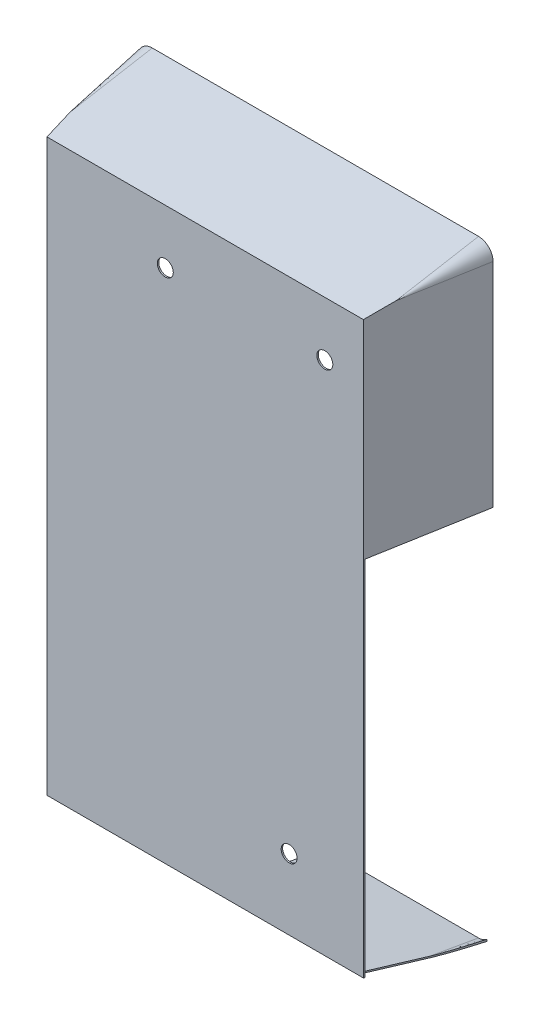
ISO-10303-21;
HEADER;
FILE_DESCRIPTION(('STEP AP214'),'2;1');
FILE_NAME('part.step','',(''),(''),'','','');
FILE_SCHEMA(('AUTOMOTIVE_DESIGN { 1 0 10303 214 1 1 1 1 }'));
ENDSEC;
DATA;
#1=APPLICATION_CONTEXT('core data for automotive mechanical design processes');
#2=APPLICATION_PROTOCOL_DEFINITION('international standard','automotive_design',2000,#1);
#3=PRODUCT_CONTEXT('',#1,'mechanical');
#4=PRODUCT('Part','Part','',(#3));
#5=PRODUCT_RELATED_PRODUCT_CATEGORY('part','',(#4));
#6=PRODUCT_DEFINITION_FORMATION('','',#4);
#7=PRODUCT_DEFINITION_CONTEXT('part definition',#1,'design');
#8=PRODUCT_DEFINITION('design','',#6,#7);
#9=PRODUCT_DEFINITION_SHAPE('','',#8);
#10=(LENGTH_UNIT() NAMED_UNIT(*) SI_UNIT(.MILLI.,.METRE.));
#11=(NAMED_UNIT(*) PLANE_ANGLE_UNIT() SI_UNIT($,.RADIAN.));
#12=(NAMED_UNIT(*) SI_UNIT($,.STERADIAN.) SOLID_ANGLE_UNIT());
#13=UNCERTAINTY_MEASURE_WITH_UNIT(LENGTH_MEASURE(1.E-05),#10,'distance_accuracy_value','');
#14=(GEOMETRIC_REPRESENTATION_CONTEXT(3) GLOBAL_UNCERTAINTY_ASSIGNED_CONTEXT((#13)) GLOBAL_UNIT_ASSIGNED_CONTEXT((#10,
#11,#12)) REPRESENTATION_CONTEXT('',''));
#15=CARTESIAN_POINT('',(0.,0.,0.));
#16=DIRECTION('',(0.,0.,1.));
#17=DIRECTION('',(1.,0.,0.));
#18=AXIS2_PLACEMENT_3D('',#15,#16,#17);
#19=CARTESIAN_POINT('',(195.,76.87,76.));
#20=DIRECTION('',(0.,0.,1.));
#21=DIRECTION('',(1.,0.,0.));
#22=AXIS2_PLACEMENT_3D('',#19,#20,#21);
#23=PLANE('',#22);
#24=CARTESIAN_POINT('',(55.,36.06819937,76.));
#25=DIRECTION('',(0.,0.,1.));
#26=DIRECTION('',(1.,0.,0.));
#27=AXIS2_PLACEMENT_3D('',#24,#25,#26);
#28=CIRCLE('',#27,5.5);
#29=CARTESIAN_POINT('',(60.5,36.06819937,76.));
#30=VERTEX_POINT('',#29);
#31=EDGE_CURVE('E542',#30,#30,#28,.F.);
#32=ORIENTED_EDGE('',*,*,#31,.T.);
#33=EDGE_LOOP('',(#32));
#34=FACE_BOUND('',#33,.T.);
#35=DIRECTION('',(0.,-1.,0.));
#36=VECTOR('',#35,1.);
#37=CARTESIAN_POINT('',(191.599149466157,76.87,76.));
#38=LINE('',#37,#36);
#39=CARTESIAN_POINT('',(191.599149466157,-319.729149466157,76.));
#40=VERTEX_POINT('',#39);
#41=CARTESIAN_POINT('',(191.599149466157,73.4691494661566,76.));
#42=VERTEX_POINT('',#41);
#43=EDGE_CURVE('E321',#40,#42,#38,.F.);
#44=ORIENTED_EDGE('',*,*,#43,.T.);
#45=DIRECTION('',(1.,0.,0.));
#46=VECTOR('',#45,1.);
#47=CARTESIAN_POINT('',(-30.,73.4691494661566,76.));
#48=LINE('',#47,#46);
#49=CARTESIAN_POINT('',(-26.5991494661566,73.4691494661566,76.));
#50=VERTEX_POINT('',#49);
#51=EDGE_CURVE('E346',#42,#50,#48,.F.);
#52=ORIENTED_EDGE('',*,*,#51,.T.);
#53=DIRECTION('',(0.,1.,0.));
#54=VECTOR('',#53,1.);
#55=CARTESIAN_POINT('',(-26.5991494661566,76.87,76.));
#56=LINE('',#55,#54);
#57=CARTESIAN_POINT('',(-26.5991494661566,-319.729149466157,76.));
#58=VERTEX_POINT('',#57);
#59=EDGE_CURVE('E348',#50,#58,#56,.F.);
#60=ORIENTED_EDGE('',*,*,#59,.T.);
#61=DIRECTION('',(-1.,0.,0.));
#62=VECTOR('',#61,1.);
#63=CARTESIAN_POINT('',(-30.,-319.729149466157,76.));
#64=LINE('',#63,#62);
#65=EDGE_CURVE('E277',#58,#40,#64,.F.);
#66=ORIENTED_EDGE('',*,*,#65,.T.);
#67=EDGE_LOOP('',(#44,#52,#60,#66));
#68=FACE_BOUND('',#67,.T.);
#69=CARTESIAN_POINT('',(164.99993658,36.06819937,76.));
#70=DIRECTION('',(0.,0.,1.));
#71=DIRECTION('',(1.,0.,0.));
#72=AXIS2_PLACEMENT_3D('',#69,#70,#71);
#73=CIRCLE('',#72,5.49999999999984);
#74=CARTESIAN_POINT('',(170.49993658,36.06819937,76.));
#75=VERTEX_POINT('',#74);
#76=EDGE_CURVE('E204',#75,#75,#73,.F.);
#77=ORIENTED_EDGE('',*,*,#76,.T.);
#78=EDGE_LOOP('',(#77));
#79=FACE_BOUND('',#78,.T.);
#80=CARTESIAN_POINT('',(140.39090384,-271.08547056,76.));
#81=DIRECTION('',(0.,0.,1.));
#82=DIRECTION('',(1.,0.,0.));
#83=AXIS2_PLACEMENT_3D('',#80,#81,#82);
#84=CIRCLE('',#83,5.50000000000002);
#85=CARTESIAN_POINT('',(145.89090384,-271.08547056,76.));
#86=VERTEX_POINT('',#85);
#87=EDGE_CURVE('E534',#86,#86,#84,.F.);
#88=ORIENTED_EDGE('',*,*,#87,.T.);
#89=EDGE_LOOP('',(#88));
#90=FACE_BOUND('',#89,.T.);
#91=ADVANCED_FACE('F27',(#34,#68,#79,#90),#23,.T.);
#92=CARTESIAN_POINT('',(195.,76.87,75.));
#93=DIRECTION('',(0.,0.,1.));
#94=DIRECTION('',(1.,0.,0.));
#95=AXIS2_PLACEMENT_3D('',#92,#93,#94);
#96=PLANE('',#95);
#97=CARTESIAN_POINT('',(55.,36.06819937,75.));
#98=DIRECTION('',(0.,0.,1.));
#99=DIRECTION('',(1.,0.,0.));
#100=AXIS2_PLACEMENT_3D('',#97,#98,#99);
#101=CIRCLE('',#100,5.5);
#102=CARTESIAN_POINT('',(60.5,36.06819937,75.));
#103=VERTEX_POINT('',#102);
#104=EDGE_CURVE('E538',#103,#103,#101,.F.);
#105=ORIENTED_EDGE('',*,*,#104,.F.);
#106=EDGE_LOOP('',(#105));
#107=FACE_BOUND('',#106,.T.);
#108=DIRECTION('',(0.,-1.,0.));
#109=VECTOR('',#108,1.);
#110=CARTESIAN_POINT('',(190.760049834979,76.87,75.));
#111=LINE('',#110,#109);
#112=CARTESIAN_POINT('',(190.760049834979,-318.890049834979,75.));
#113=VERTEX_POINT('',#112);
#114=CARTESIAN_POINT('',(190.760049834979,-70.,75.));
#115=VERTEX_POINT('',#114);
#116=EDGE_CURVE('E586',#113,#115,#111,.F.);
#117=ORIENTED_EDGE('',*,*,#116,.F.);
#118=DIRECTION('',(-1.,0.,0.));
#119=VECTOR('',#118,1.);
#120=CARTESIAN_POINT('',(-30.,-318.890049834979,75.));
#121=LINE('',#120,#119);
#122=CARTESIAN_POINT('',(-25.7600498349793,-318.890049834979,75.));
#123=VERTEX_POINT('',#122);
#124=EDGE_CURVE('E590',#123,#113,#121,.F.);
#125=ORIENTED_EDGE('',*,*,#124,.F.);
#126=DIRECTION('',(0.,1.,0.));
#127=VECTOR('',#126,1.);
#128=CARTESIAN_POINT('',(-25.7600498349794,76.87,75.));
#129=LINE('',#128,#127);
#130=CARTESIAN_POINT('',(-25.7600498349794,72.6300498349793,75.));
#131=VERTEX_POINT('',#130);
#132=EDGE_CURVE('E593',#131,#123,#129,.F.);
#133=ORIENTED_EDGE('',*,*,#132,.F.);
#134=DIRECTION('',(1.,0.,0.));
#135=VECTOR('',#134,1.);
#136=CARTESIAN_POINT('',(-30.,72.6300498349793,75.));
#137=LINE('',#136,#135);
#138=CARTESIAN_POINT('',(190.760049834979,72.6300498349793,75.));
#139=VERTEX_POINT('',#138);
#140=EDGE_CURVE('E570',#139,#131,#137,.F.);
#141=ORIENTED_EDGE('',*,*,#140,.F.);
#142=EDGE_CURVE('E589',#115,#139,#111,.F.);
#143=ORIENTED_EDGE('',*,*,#142,.F.);
#144=EDGE_LOOP('',(#117,#125,#133,#141,#143));
#145=FACE_BOUND('',#144,.T.);
#146=CARTESIAN_POINT('',(164.99993658,36.06819937,75.));
#147=DIRECTION('',(0.,0.,1.));
#148=DIRECTION('',(1.,0.,0.));
#149=AXIS2_PLACEMENT_3D('',#146,#147,#148);
#150=CIRCLE('',#149,5.49999999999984);
#151=CARTESIAN_POINT('',(170.49993658,36.06819937,75.));
#152=VERTEX_POINT('',#151);
#153=EDGE_CURVE('E545',#152,#152,#150,.F.);
#154=ORIENTED_EDGE('',*,*,#153,.F.);
#155=EDGE_LOOP('',(#154));
#156=FACE_BOUND('',#155,.T.);
#157=CARTESIAN_POINT('',(140.39090384,-271.08547056,75.));
#158=DIRECTION('',(0.,0.,1.));
#159=DIRECTION('',(1.,0.,0.));
#160=AXIS2_PLACEMENT_3D('',#157,#158,#159);
#161=CIRCLE('',#160,5.50000000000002);
#162=CARTESIAN_POINT('',(145.89090384,-271.08547056,75.));
#163=VERTEX_POINT('',#162);
#164=EDGE_CURVE('E31',#163,#163,#161,.F.);
#165=ORIENTED_EDGE('',*,*,#164,.F.);
#166=EDGE_LOOP('',(#165));
#167=FACE_BOUND('',#166,.T.);
#168=ADVANCED_FACE('F292',(#107,#145,#156,#167),#96,.F.);
#169=CARTESIAN_POINT('',(195.,76.87,0.));
#170=DIRECTION('',(0.,0.,1.));
#171=DIRECTION('',(1.,0.,0.));
#172=AXIS2_PLACEMENT_3D('',#169,#170,#171);
#173=PLANE('',#172);
#174=DIRECTION('',(1.,0.,0.));
#175=VECTOR('',#174,1.);
#176=CARTESIAN_POINT('',(-30.,-333.13,0.));
#177=LINE('',#176,#175);
#178=CARTESIAN_POINT('',(88.3302066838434,-333.13,0.));
#179=VERTEX_POINT('',#178);
#180=CARTESIAN_POINT('',(195.,-333.13,0.));
#181=VERTEX_POINT('',#180);
#182=EDGE_CURVE('E373',#179,#181,#177,.T.);
#183=ORIENTED_EDGE('',*,*,#182,.F.);
#184=DIRECTION('',(0.,1.,0.));
#185=VECTOR('',#184,1.);
#186=CARTESIAN_POINT('',(88.3302066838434,76.87,0.));
#187=LINE('',#186,#185);
#188=CARTESIAN_POINT('',(88.3302066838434,-332.114573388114,0.));
#189=VERTEX_POINT('',#188);
#190=EDGE_CURVE('E201',#179,#189,#187,.T.);
#191=ORIENTED_EDGE('',*,*,#190,.T.);
#192=DIRECTION('',(-1.,0.,0.));
#193=VECTOR('',#192,1.);
#194=CARTESIAN_POINT('',(-30.,-332.114573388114,0.));
#195=LINE('',#194,#193);
#196=CARTESIAN_POINT('',(195.,-332.114573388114,0.));
#197=VERTEX_POINT('',#196);
#198=EDGE_CURVE('E556',#189,#197,#195,.F.);
#199=ORIENTED_EDGE('',*,*,#198,.T.);
#200=CARTESIAN_POINT('',(195.,-323.13,0.));
#201=DIRECTION('',(0.,0.,1.));
#202=DIRECTION('',(1.,0.,0.));
#203=AXIS2_PLACEMENT_3D('',#200,#201,#202);
#204=CIRCLE('',#203,8.98457338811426);
#205=CARTESIAN_POINT('',(200.938293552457,-329.872345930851,0.));
#206=VERTEX_POINT('',#205);
#207=EDGE_CURVE('E565',#197,#206,#204,.T.);
#208=ORIENTED_EDGE('',*,*,#207,.T.);
#209=DIRECTION('',(0.,1.,0.));
#210=VECTOR('',#209,1.);
#211=CARTESIAN_POINT('',(200.938293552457,76.87,0.));
#212=LINE('',#211,#210);
#213=CARTESIAN_POINT('',(200.938293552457,-331.175910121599,0.));
#214=VERTEX_POINT('',#213);
#215=EDGE_CURVE('E240',#214,#206,#212,.T.);
#216=ORIENTED_EDGE('',*,*,#215,.F.);
#217=CARTESIAN_POINT('',(195.,-323.13,0.));
#218=DIRECTION('',(0.,0.,1.));
#219=DIRECTION('',(-1.,0.,0.));
#220=AXIS2_PLACEMENT_3D('',#217,#218,#219);
#221=CIRCLE('',#220,10.);
#222=EDGE_CURVE('E378',#181,#214,#221,.T.);
#223=ORIENTED_EDGE('',*,*,#222,.F.);
#224=EDGE_LOOP('',(#183,#191,#199,#208,#216,#223));
#225=FACE_BOUND('',#224,.T.);
#226=ADVANCED_FACE('F295',(#225),#173,.F.);
#227=CARTESIAN_POINT('',(195.,-323.13,0.));
#228=DIRECTION('',(0.,0.,-1.));
#229=DIRECTION('',(-1.,0.,0.));
#230=AXIS2_PLACEMENT_3D('',#227,#228,#229);
#231=CONICAL_SURFACE('',#230,10.,0.174532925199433);
#232=CARTESIAN_POINT('',(194.9998,-327.191506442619,33.6788705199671));
#233=CARTESIAN_POINT('',(195.049157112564,-327.24086200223,33.3989524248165));
#234=CARTESIAN_POINT('',(195.098540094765,-327.289352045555,33.1188876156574));
#235=CARTESIAN_POINT('',(195.197351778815,-327.384751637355,32.5584987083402));
#236=CARTESIAN_POINT('',(195.246780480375,-327.431661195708,32.278174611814));
#237=CARTESIAN_POINT('',(195.395123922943,-327.570242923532,31.4368771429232));
#238=CARTESIAN_POINT('',(195.494099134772,-327.659771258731,30.8755608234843));
#239=CARTESIAN_POINT('',(195.692155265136,-327.834009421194,29.7523286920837));
#240=CARTESIAN_POINT('',(195.791236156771,-327.918720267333,29.1904130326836));
#241=CARTESIAN_POINT('',(195.989501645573,-328.084029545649,28.0659935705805));
#242=CARTESIAN_POINT('',(196.088686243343,-328.164627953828,27.5034897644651));
#243=CARTESIAN_POINT('',(196.385040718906,-328.400039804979,25.8227800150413));
#244=CARTESIAN_POINT('',(196.582336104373,-328.549618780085,24.7038622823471));
#245=CARTESIAN_POINT('',(196.977168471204,-328.837846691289,22.464656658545));
#246=CARTESIAN_POINT('',(197.174705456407,-328.976495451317,21.3443687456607));
#247=CARTESIAN_POINT('',(197.569976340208,-329.244936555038,19.1026761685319));
#248=CARTESIAN_POINT('',(197.767710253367,-329.374728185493,17.9812714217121));
#249=CARTESIAN_POINT('',(198.163319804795,-329.626945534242,15.7376581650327));
#250=CARTESIAN_POINT('',(198.361195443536,-329.74937122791,14.6154496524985));
#251=CARTESIAN_POINT('',(198.757237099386,-329.988082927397,12.3693858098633));
#252=CARTESIAN_POINT('',(198.955403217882,-330.104363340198,11.2455299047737));
#253=CARTESIAN_POINT('',(199.351829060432,-330.331531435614,8.99728723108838));
#254=CARTESIAN_POINT('',(199.55008878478,-330.44241910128,7.87290046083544));
#255=CARTESIAN_POINT('',(199.946641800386,-330.659466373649,5.62393655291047));
#256=CARTESIAN_POINT('',(200.144935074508,-330.765627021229,4.49935951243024));
#257=CARTESIAN_POINT('',(200.541586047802,-330.973774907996,2.24984005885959));
#258=CARTESIAN_POINT('',(200.739943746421,-331.075762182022,1.12489764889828));
#259=CARTESIAN_POINT('',(200.938328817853,-331.175927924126,-0.000199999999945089));
#260=B_SPLINE_CURVE_WITH_KNOTS('',3,(#232,#233,#234,#235,#236,#237,#238,#239,#240,#241,#242,
#243,#244,#245,#246,#247,#248,#249,#250,#251,#252,#253,#254,#255,#256,#257,#258,#259),
.UNSPECIFIED.,.F.,.F.,(4,2,2,2,2,2,2,2,2,2,2,2,2,4),(0.,0.865465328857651,1.73092524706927,
3.46179016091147,5.19228763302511,6.92279520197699,10.3606659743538,13.7985921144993,
17.2367947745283,20.6750089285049,24.116300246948,27.5576023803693,30.9981429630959,
34.4386548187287),.UNSPECIFIED.);
#261=CARTESIAN_POINT('',(195.,-327.191706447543,33.6777362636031));
#262=VERTEX_POINT('',#261);
#263=EDGE_CURVE('E242',#262,#214,#260,.T.);
#264=ORIENTED_EDGE('',*,*,#263,.F.);
#265=DIRECTION('',(0.,-0.173648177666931,-0.984807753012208));
#266=VECTOR('',#265,1.);
#267=CARTESIAN_POINT('',(195.,-333.13,0.));
#268=LINE('',#267,#266);
#269=EDGE_CURVE('E323',#262,#181,#268,.T.);
#270=ORIENTED_EDGE('',*,*,#269,.T.);
#271=ORIENTED_EDGE('',*,*,#222,.T.);
#272=EDGE_LOOP('',(#264,#270,#271));
#273=FACE_BOUND('',#272,.T.);
#274=ADVANCED_FACE('F251',(#273),#231,.T.);
#275=CARTESIAN_POINT('',(195.,-323.13,-0.173648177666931));
#276=DIRECTION('',(0.,0.,-1.));
#277=DIRECTION('',(-1.,0.,0.));
#278=AXIS2_PLACEMENT_3D('',#275,#276,#277);
#279=CONICAL_SURFACE('',#278,9.0151922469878,0.174532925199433);
#280=DIRECTION('',(0.,-0.173648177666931,-0.984807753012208));
#281=VECTOR('',#280,1.);
#282=CARTESIAN_POINT('',(195.,-332.145192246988,-0.173648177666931));
#283=LINE('',#282,#281);
#284=CARTESIAN_POINT('',(195.,-326.176279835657,33.6777362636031));
#285=VERTEX_POINT('',#284);
#286=EDGE_CURVE('E594',#285,#197,#283,.T.);
#287=ORIENTED_EDGE('',*,*,#286,.F.);
#288=CARTESIAN_POINT('',(194.9998,-326.176079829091,33.6788705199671));
#289=CARTESIAN_POINT('',(195.07383496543,-326.250073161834,33.2589973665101));
#290=CARTESIAN_POINT('',(195.147944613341,-326.321537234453,32.8387006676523));
#291=CARTESIAN_POINT('',(195.296283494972,-326.460138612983,31.9974290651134));
#292=CARTESIAN_POINT('',(195.370512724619,-326.527276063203,31.5764541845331));
#293=CARTESIAN_POINT('',(195.519052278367,-326.657948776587,30.7340445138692));
#294=CARTESIAN_POINT('',(195.593362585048,-326.72148469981,30.3126098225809));
#295=CARTESIAN_POINT('',(195.7420613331,-326.845469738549,29.4692973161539));
#296=CARTESIAN_POINT('',(195.816449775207,-326.905918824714,29.0474194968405));
#297=CARTESIAN_POINT('',(196.039741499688,-327.083294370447,27.7810691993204));
#298=CARTESIAN_POINT('',(196.188740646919,-327.196222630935,26.9360530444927));
#299=CARTESIAN_POINT('',(196.486922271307,-327.41378068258,25.2449810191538));
#300=CARTESIAN_POINT('',(196.636104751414,-327.518410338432,24.3989251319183));
#301=CARTESIAN_POINT('',(196.934613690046,-327.72095008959,22.7059968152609));
#302=CARTESIAN_POINT('',(197.083940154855,-327.818859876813,21.8591243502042));
#303=CARTESIAN_POINT('',(197.382700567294,-328.009098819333,20.1647698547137));
#304=CARTESIAN_POINT('',(197.532134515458,-328.101427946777,19.317287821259));
#305=CARTESIAN_POINT('',(197.831137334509,-328.281387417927,17.6215585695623));
#306=CARTESIAN_POINT('',(197.980706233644,-328.36901620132,16.7733111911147));
#307=CARTESIAN_POINT('',(198.279914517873,-328.540194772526,15.0764166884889));
#308=CARTESIAN_POINT('',(198.429553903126,-328.623744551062,14.2277695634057));
#309=CARTESIAN_POINT('',(198.878550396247,-328.869072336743,11.6813839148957));
#310=CARTESIAN_POINT('',(199.177995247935,-329.025534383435,9.9831477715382));
#311=CARTESIAN_POINT('',(199.720938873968,-329.299069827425,6.90396145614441));
#312=CARTESIAN_POINT('',(199.96440928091,-329.418031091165,5.52317216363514));
#313=CARTESIAN_POINT('',(200.451351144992,-329.649645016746,2.7615876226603));
#314=CARTESIAN_POINT('',(200.69482256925,-329.76229996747,1.38079256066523));
#315=CARTESIAN_POINT('',(200.938328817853,-329.872361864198,-0.000199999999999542));
#316=B_SPLINE_CURVE_WITH_KNOTS('',3,(#288,#289,#290,#291,#292,#293,#294,#295,#296,#297,#298,
#299,#300,#301,#302,#303,#304,#305,#306,#307,#308,#309,#310,#311,#312,#313,#314,#315),
.UNSPECIFIED.,.F.,.F.,(4,2,2,2,2,2,2,2,2,2,2,2,2,4),(0.,1.29815030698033,2.59625729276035,
3.89412559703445,5.19200623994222,7.78830093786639,10.3846379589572,12.9810939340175,
15.5775628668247,18.174888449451,20.7722199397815,25.9667195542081,30.1880902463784,
34.4079187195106),.UNSPECIFIED.);
#317=EDGE_CURVE('E268',#285,#206,#316,.T.);
#318=ORIENTED_EDGE('',*,*,#317,.T.);
#319=ORIENTED_EDGE('',*,*,#207,.F.);
#320=EDGE_LOOP('',(#287,#318,#319));
#321=FACE_BOUND('',#320,.T.);
#322=ADVANCED_FACE('F280',(#321),#279,.F.);
#323=CARTESIAN_POINT('',(195.,76.87,0.));
#324=DIRECTION('',(0.,0.,-1.));
#325=DIRECTION('',(1.,0.,0.));
#326=AXIS2_PLACEMENT_3D('',#323,#324,#325);
#327=CONICAL_SURFACE('',#326,9.99999999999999,0.174532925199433);
#328=DIRECTION('',(0.,0.173648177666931,-0.984807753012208));
#329=VECTOR('',#328,1.);
#330=CARTESIAN_POINT('',(195.,86.87,0.));
#331=LINE('',#330,#329);
#332=CARTESIAN_POINT('',(195.,76.87,56.7128181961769));
#333=VERTEX_POINT('',#332);
#334=CARTESIAN_POINT('',(195.,86.87,0.));
#335=VERTEX_POINT('',#334);
#336=EDGE_CURVE('E344',#333,#335,#331,.T.);
#337=ORIENTED_EDGE('',*,*,#336,.F.);
#338=DIRECTION('',(0.173648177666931,0.,-0.984807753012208));
#339=VECTOR('',#338,1.);
#340=CARTESIAN_POINT('',(205.,76.87,0.));
#341=LINE('',#340,#339);
#342=CARTESIAN_POINT('',(205.,76.87,0.));
#343=VERTEX_POINT('',#342);
#344=EDGE_CURVE('E324',#333,#343,#341,.T.);
#345=ORIENTED_EDGE('',*,*,#344,.T.);
#346=CARTESIAN_POINT('',(195.,76.87,0.));
#347=DIRECTION('',(0.,0.,1.));
#348=DIRECTION('',(1.,0.,0.));
#349=AXIS2_PLACEMENT_3D('',#346,#347,#348);
#350=CIRCLE('',#349,9.99999999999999);
#351=EDGE_CURVE('E390',#343,#335,#350,.T.);
#352=ORIENTED_EDGE('',*,*,#351,.T.);
#353=EDGE_LOOP('',(#337,#345,#352));
#354=FACE_BOUND('',#353,.T.);
#355=ADVANCED_FACE('F285',(#354),#327,.T.);
#356=CARTESIAN_POINT('',(-30.,86.87,0.));
#357=DIRECTION('',(0.,0.984807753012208,0.173648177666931));
#358=DIRECTION('',(0.,-0.173648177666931,0.984807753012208));
#359=AXIS2_PLACEMENT_3D('',#356,#357,#358);
#360=PLANE('',#359);
#361=DIRECTION('',(-1.,0.,0.));
#362=VECTOR('',#361,1.);
#363=CARTESIAN_POINT('',(-30.,86.87,0.));
#364=LINE('',#363,#362);
#365=CARTESIAN_POINT('',(-30.,86.87,0.));
#366=VERTEX_POINT('',#365);
#367=EDGE_CURVE('E393',#335,#366,#364,.T.);
#368=ORIENTED_EDGE('',*,*,#367,.T.);
#369=DIRECTION('',(0.,0.173648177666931,-0.984807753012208));
#370=VECTOR('',#369,1.);
#371=CARTESIAN_POINT('',(-30.,86.87,0.));
#372=LINE('',#371,#370);
#373=CARTESIAN_POINT('',(-30.,76.87,56.7128181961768));
#374=VERTEX_POINT('',#373);
#375=EDGE_CURVE('E341',#374,#366,#372,.T.);
#376=ORIENTED_EDGE('',*,*,#375,.F.);
#377=DIRECTION('',(-0.171087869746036,0.171087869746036,-0.970287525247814));
#378=VECTOR('',#377,1.);
#379=CARTESIAN_POINT('',(-39.7072894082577,86.5772894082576,1.66004425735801));
#380=LINE('',#379,#378);
#381=EDGE_CURVE('E339',#50,#374,#380,.T.);
#382=ORIENTED_EDGE('',*,*,#381,.F.);
#383=ORIENTED_EDGE('',*,*,#51,.F.);
#384=DIRECTION('',(0.171087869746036,0.171087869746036,-0.970287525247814));
#385=VECTOR('',#384,1.);
#386=CARTESIAN_POINT('',(198.121301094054,79.9913010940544,39.0110400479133));
#387=LINE('',#386,#385);
#388=EDGE_CURVE('E276',#42,#333,#387,.T.);
#389=ORIENTED_EDGE('',*,*,#388,.T.);
#390=ORIENTED_EDGE('',*,*,#336,.T.);
#391=EDGE_LOOP('',(#368,#376,#382,#383,#389,#390));
#392=FACE_BOUND('',#391,.T.);
#393=ADVANCED_FACE('F29',(#392),#360,.T.);
#394=CARTESIAN_POINT('',(-30.,76.87,0.));
#395=DIRECTION('',(0.,0.,-1.));
#396=DIRECTION('',(-1.,0.,0.));
#397=AXIS2_PLACEMENT_3D('',#394,#395,#396);
#398=CONICAL_SURFACE('',#397,9.99999999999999,0.174532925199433);
#399=DIRECTION('',(-0.173648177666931,0.,-0.984807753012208));
#400=VECTOR('',#399,1.);
#401=CARTESIAN_POINT('',(-40.,76.87,0.));
#402=LINE('',#401,#400);
#403=CARTESIAN_POINT('',(-40.,76.87,0.));
#404=VERTEX_POINT('',#403);
#405=EDGE_CURVE('E338',#374,#404,#402,.T.);
#406=ORIENTED_EDGE('',*,*,#405,.F.);
#407=ORIENTED_EDGE('',*,*,#375,.T.);
#408=CARTESIAN_POINT('',(-30.,76.87,0.));
#409=DIRECTION('',(0.,0.,1.));
#410=DIRECTION('',(-1.,0.,0.));
#411=AXIS2_PLACEMENT_3D('',#408,#409,#410);
#412=CIRCLE('',#411,9.99999999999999);
#413=EDGE_CURVE('E369',#366,#404,#412,.T.);
#414=ORIENTED_EDGE('',*,*,#413,.T.);
#415=EDGE_LOOP('',(#406,#407,#414));
#416=FACE_BOUND('',#415,.T.);
#417=ADVANCED_FACE('F403',(#416),#398,.T.);
#418=CARTESIAN_POINT('',(-40.,76.87,0.));
#419=DIRECTION('',(-0.984807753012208,0.,0.173648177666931));
#420=DIRECTION('',(0.173648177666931,0.,0.984807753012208));
#421=AXIS2_PLACEMENT_3D('',#418,#419,#420);
#422=PLANE('',#421);
#423=DIRECTION('',(0.,-1.,0.));
#424=VECTOR('',#423,1.);
#425=CARTESIAN_POINT('',(-40.,76.87,0.));
#426=LINE('',#425,#424);
#427=CARTESIAN_POINT('',(-40.,-323.13,0.));
#428=VERTEX_POINT('',#427);
#429=EDGE_CURVE('E365',#404,#428,#426,.T.);
#430=ORIENTED_EDGE('',*,*,#429,.T.);
#431=DIRECTION('',(-0.173648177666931,0.,-0.984807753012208));
#432=VECTOR('',#431,1.);
#433=CARTESIAN_POINT('',(-40.,-323.13,0.));
#434=LINE('',#433,#432);
#435=CARTESIAN_POINT('',(-30.,-323.13,56.7128181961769));
#436=VERTEX_POINT('',#435);
#437=EDGE_CURVE('E335',#436,#428,#434,.T.);
#438=ORIENTED_EDGE('',*,*,#437,.F.);
#439=DIRECTION('',(-0.171087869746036,-0.171087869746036,-0.970287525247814));
#440=VECTOR('',#439,1.);
#441=CARTESIAN_POINT('',(-39.7072894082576,-332.837289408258,1.66004425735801));
#442=LINE('',#441,#440);
#443=EDGE_CURVE('E333',#58,#436,#442,.T.);
#444=ORIENTED_EDGE('',*,*,#443,.F.);
#445=ORIENTED_EDGE('',*,*,#59,.F.);
#446=ORIENTED_EDGE('',*,*,#381,.T.);
#447=ORIENTED_EDGE('',*,*,#405,.T.);
#448=EDGE_LOOP('',(#430,#438,#444,#445,#446,#447));
#449=FACE_BOUND('',#448,.T.);
#450=ADVANCED_FACE('F363',(#449),#422,.T.);
#451=CARTESIAN_POINT('',(-30.,-323.13,0.));
#452=DIRECTION('',(0.,0.,-1.));
#453=DIRECTION('',(-1.,0.,0.));
#454=AXIS2_PLACEMENT_3D('',#451,#452,#453);
#455=CONICAL_SURFACE('',#454,10.,0.174532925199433);
#456=DIRECTION('',(0.,-0.173648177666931,-0.984807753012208));
#457=VECTOR('',#456,1.);
#458=CARTESIAN_POINT('',(-30.,-333.13,0.));
#459=LINE('',#458,#457);
#460=CARTESIAN_POINT('',(-30.,-333.13,0.));
#461=VERTEX_POINT('',#460);
#462=EDGE_CURVE('E327',#436,#461,#459,.T.);
#463=ORIENTED_EDGE('',*,*,#462,.F.);
#464=ORIENTED_EDGE('',*,*,#437,.T.);
#465=CARTESIAN_POINT('',(-30.,-323.13,0.));
#466=DIRECTION('',(0.,0.,1.));
#467=DIRECTION('',(-1.,0.,0.));
#468=AXIS2_PLACEMENT_3D('',#465,#466,#467);
#469=CIRCLE('',#468,10.);
#470=EDGE_CURVE('E361',#428,#461,#469,.T.);
#471=ORIENTED_EDGE('',*,*,#470,.T.);
#472=EDGE_LOOP('',(#463,#464,#471));
#473=FACE_BOUND('',#472,.T.);
#474=ADVANCED_FACE('F313',(#473),#455,.T.);
#475=CARTESIAN_POINT('',(-30.,-333.13,0.));
#476=DIRECTION('',(0.,-0.984807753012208,0.173648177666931));
#477=DIRECTION('',(0.,-0.173648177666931,-0.984807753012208));
#478=AXIS2_PLACEMENT_3D('',#475,#476,#477);
#479=PLANE('',#478);
#480=DIRECTION('',(-1.,0.,0.));
#481=VECTOR('',#480,1.);
#482=CARTESIAN_POINT('',(88.3302066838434,-320.974627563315,68.9365427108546));
#483=LINE('',#482,#481);
#484=CARTESIAN_POINT('',(88.3302066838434,-320.974627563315,68.9365427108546));
#485=VERTEX_POINT('',#484);
#486=CARTESIAN_POINT('',(13.4008505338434,-320.974627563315,68.9365427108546));
#487=VERTEX_POINT('',#486);
#488=EDGE_CURVE('E189',#485,#487,#483,.T.);
#489=ORIENTED_EDGE('',*,*,#488,.F.);
#490=DIRECTION('',(0.,0.17364817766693,0.984807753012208));
#491=VECTOR('',#490,1.);
#492=CARTESIAN_POINT('',(88.3302066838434,-333.13,0.));
#493=LINE('',#492,#491);
#494=EDGE_CURVE('E198',#179,#485,#493,.T.);
#495=ORIENTED_EDGE('',*,*,#494,.F.);
#496=ORIENTED_EDGE('',*,*,#182,.T.);
#497=ORIENTED_EDGE('',*,*,#269,.F.);
#498=DIRECTION('',(-0.171087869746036,0.171087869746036,0.970287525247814));
#499=VECTOR('',#498,1.);
#500=CARTESIAN_POINT('',(194.178485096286,-326.370191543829,38.3367788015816));
#501=LINE('',#500,#499);
#502=CARTESIAN_POINT('',(187.805626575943,-319.997333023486,74.4790554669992));
#503=VERTEX_POINT('',#502);
#504=EDGE_CURVE('E249',#503,#262,#501,.F.);
#505=ORIENTED_EDGE('',*,*,#504,.F.);
#506=DIRECTION('',(-0.984346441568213,-0.0306045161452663,-0.173566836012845));
#507=VECTOR('',#506,1.);
#508=CARTESIAN_POINT('',(-36.3548699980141,-326.966752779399,34.9535119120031));
#509=LINE('',#508,#507);
#510=CARTESIAN_POINT('',(191.744857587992,-319.874857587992,75.1736481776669));
#511=VERTEX_POINT('',#510);
#512=EDGE_CURVE('E234',#503,#511,#509,.F.);
#513=ORIENTED_EDGE('',*,*,#512,.T.);
#514=DIRECTION('',(0.171087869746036,-0.171087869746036,-0.970287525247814));
#515=VECTOR('',#514,1.);
#516=CARTESIAN_POINT('',(192.998865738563,-321.128865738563,68.0618145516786));
#517=LINE('',#516,#515);
#518=EDGE_CURVE('E317',#40,#511,#517,.T.);
#519=ORIENTED_EDGE('',*,*,#518,.F.);
#520=ORIENTED_EDGE('',*,*,#65,.F.);
#521=ORIENTED_EDGE('',*,*,#443,.T.);
#522=ORIENTED_EDGE('',*,*,#462,.T.);
#523=CARTESIAN_POINT('',(13.4008505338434,-333.13,0.));
#524=VERTEX_POINT('',#523);
#525=EDGE_CURVE('E372',#461,#524,#177,.T.);
#526=ORIENTED_EDGE('',*,*,#525,.T.);
#527=DIRECTION('',(0.,-0.17364817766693,-0.984807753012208));
#528=VECTOR('',#527,1.);
#529=CARTESIAN_POINT('',(13.4008505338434,-333.13,0.));
#530=LINE('',#529,#528);
#531=EDGE_CURVE('E195',#487,#524,#530,.T.);
#532=ORIENTED_EDGE('',*,*,#531,.F.);
#533=EDGE_LOOP('',(#489,#495,#496,#497,#505,#513,#519,#520,#521,#522,#526,#532));
#534=FACE_BOUND('',#533,.T.);
#535=ADVANCED_FACE('F206',(#534),#479,.T.);
#536=CARTESIAN_POINT('',(205.,76.87,0.));
#537=DIRECTION('',(0.984807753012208,0.,0.173648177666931));
#538=DIRECTION('',(0.173648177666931,0.,-0.984807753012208));
#539=AXIS2_PLACEMENT_3D('',#536,#537,#538);
#540=PLANE('',#539);
#541=ORIENTED_EDGE('',*,*,#518,.T.);
#542=DIRECTION('',(0.,-1.,0.));
#543=VECTOR('',#542,1.);
#544=CARTESIAN_POINT('',(191.744857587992,-70.,75.173648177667));
#545=LINE('',#544,#543);
#546=CARTESIAN_POINT('',(191.744857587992,-70.,75.173648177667));
#547=VERTEX_POINT('',#546);
#548=EDGE_CURVE('E217',#547,#511,#545,.T.);
#549=ORIENTED_EDGE('',*,*,#548,.F.);
#550=DIRECTION('',(-0.173648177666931,0.,0.984807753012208));
#551=VECTOR('',#550,1.);
#552=CARTESIAN_POINT('',(191.744857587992,-70.,75.173648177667));
#553=LINE('',#552,#551);
#554=CARTESIAN_POINT('',(205.,-70.,0.));
#555=VERTEX_POINT('',#554);
#556=EDGE_CURVE('E219',#555,#547,#553,.T.);
#557=ORIENTED_EDGE('',*,*,#556,.F.);
#558=DIRECTION('',(0.,1.,0.));
#559=VECTOR('',#558,1.);
#560=CARTESIAN_POINT('',(205.,76.87,0.));
#561=LINE('',#560,#559);
#562=EDGE_CURVE('E349',#555,#343,#561,.T.);
#563=ORIENTED_EDGE('',*,*,#562,.T.);
#564=ORIENTED_EDGE('',*,*,#344,.F.);
#565=ORIENTED_EDGE('',*,*,#388,.F.);
#566=ORIENTED_EDGE('',*,*,#43,.F.);
#567=EDGE_LOOP('',(#541,#549,#557,#563,#564,#565,#566));
#568=FACE_BOUND('',#567,.T.);
#569=ADVANCED_FACE('F301',(#568),#540,.T.);
#570=CARTESIAN_POINT('',(-30.,-332.114573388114,0.));
#571=VERTEX_POINT('',#570);
#572=CARTESIAN_POINT('',(13.4008505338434,-332.114573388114,0.));
#573=VERTEX_POINT('',#572);
#574=EDGE_CURVE('E568',#571,#573,#195,.F.);
#575=ORIENTED_EDGE('',*,*,#574,.T.);
#576=DIRECTION('',(0.,-1.,0.));
#577=VECTOR('',#576,1.);
#578=CARTESIAN_POINT('',(13.4008505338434,76.87,0.));
#579=LINE('',#578,#577);
#580=EDGE_CURVE('E212',#573,#524,#579,.T.);
#581=ORIENTED_EDGE('',*,*,#580,.T.);
#582=ORIENTED_EDGE('',*,*,#525,.F.);
#583=ORIENTED_EDGE('',*,*,#470,.F.);
#584=ORIENTED_EDGE('',*,*,#429,.F.);
#585=ORIENTED_EDGE('',*,*,#413,.F.);
#586=ORIENTED_EDGE('',*,*,#367,.F.);
#587=ORIENTED_EDGE('',*,*,#351,.F.);
#588=ORIENTED_EDGE('',*,*,#562,.F.);
#589=DIRECTION('',(-1.,0.,0.));
#590=VECTOR('',#589,1.);
#591=CARTESIAN_POINT('',(195.,-70.,0.));
#592=LINE('',#591,#590);
#593=CARTESIAN_POINT('',(203.984573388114,-70.,0.));
#594=VERTEX_POINT('',#593);
#595=EDGE_CURVE('E229',#555,#594,#592,.T.);
#596=ORIENTED_EDGE('',*,*,#595,.T.);
#597=DIRECTION('',(0.,-1.,0.));
#598=VECTOR('',#597,1.);
#599=CARTESIAN_POINT('',(203.984573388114,76.87,0.));
#600=LINE('',#599,#598);
#601=CARTESIAN_POINT('',(203.984573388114,76.87,0.));
#602=VERTEX_POINT('',#601);
#603=EDGE_CURVE('E567',#594,#602,#600,.F.);
#604=ORIENTED_EDGE('',*,*,#603,.T.);
#605=CARTESIAN_POINT('',(195.,76.87,0.));
#606=DIRECTION('',(0.,0.,1.));
#607=DIRECTION('',(1.,0.,0.));
#608=AXIS2_PLACEMENT_3D('',#605,#606,#607);
#609=CIRCLE('',#608,8.98457338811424);
#610=CARTESIAN_POINT('',(195.,85.8545733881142,0.));
#611=VERTEX_POINT('',#610);
#612=EDGE_CURVE('E581',#602,#611,#609,.T.);
#613=ORIENTED_EDGE('',*,*,#612,.T.);
#614=DIRECTION('',(1.,0.,0.));
#615=VECTOR('',#614,1.);
#616=CARTESIAN_POINT('',(-30.,85.8545733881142,0.));
#617=LINE('',#616,#615);
#618=CARTESIAN_POINT('',(-30.,85.8545733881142,0.));
#619=VERTEX_POINT('',#618);
#620=EDGE_CURVE('E400',#611,#619,#617,.F.);
#621=ORIENTED_EDGE('',*,*,#620,.T.);
#622=CARTESIAN_POINT('',(-30.,76.87,0.));
#623=DIRECTION('',(0.,0.,1.));
#624=DIRECTION('',(1.,0.,0.));
#625=AXIS2_PLACEMENT_3D('',#622,#623,#624);
#626=CIRCLE('',#625,8.98457338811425);
#627=CARTESIAN_POINT('',(-38.9845733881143,76.87,0.));
#628=VERTEX_POINT('',#627);
#629=EDGE_CURVE('E52',#619,#628,#626,.T.);
#630=ORIENTED_EDGE('',*,*,#629,.T.);
#631=DIRECTION('',(0.,1.,0.));
#632=VECTOR('',#631,1.);
#633=CARTESIAN_POINT('',(-38.9845733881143,76.87,0.));
#634=LINE('',#633,#632);
#635=CARTESIAN_POINT('',(-38.9845733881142,-323.13,0.));
#636=VERTEX_POINT('',#635);
#637=EDGE_CURVE('E578',#628,#636,#634,.F.);
#638=ORIENTED_EDGE('',*,*,#637,.T.);
#639=CARTESIAN_POINT('',(-30.,-323.13,0.));
#640=DIRECTION('',(0.,0.,1.));
#641=DIRECTION('',(1.,0.,0.));
#642=AXIS2_PLACEMENT_3D('',#639,#640,#641);
#643=CIRCLE('',#642,8.98457338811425);
#644=EDGE_CURVE('E575',#636,#571,#643,.T.);
#645=ORIENTED_EDGE('',*,*,#644,.T.);
#646=EDGE_LOOP('',(#575,#581,#582,#583,#584,#585,#586,#587,#588,#596,#604,#613,#621,#630,#638,#645));
#647=FACE_BOUND('',#646,.T.);
#648=ADVANCED_FACE('F297',(#647),#173,.F.);
#649=CARTESIAN_POINT('',(195.,76.87,-0.173648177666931));
#650=DIRECTION('',(0.,0.,-1.));
#651=DIRECTION('',(1.,0.,0.));
#652=AXIS2_PLACEMENT_3D('',#649,#650,#651);
#653=CONICAL_SURFACE('',#652,9.01519224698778,0.174532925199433);
#654=DIRECTION('',(0.,-0.173648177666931,0.984807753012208));
#655=VECTOR('',#654,1.);
#656=CARTESIAN_POINT('',(195.,85.8851922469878,-0.173648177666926));
#657=LINE('',#656,#655);
#658=CARTESIAN_POINT('',(195.,76.87,50.9540477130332));
#659=VERTEX_POINT('',#658);
#660=EDGE_CURVE('E397',#659,#611,#657,.F.);
#661=ORIENTED_EDGE('',*,*,#660,.T.);
#662=ORIENTED_EDGE('',*,*,#612,.F.);
#663=DIRECTION('',(0.173648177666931,0.,-0.984807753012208));
#664=VECTOR('',#663,1.);
#665=CARTESIAN_POINT('',(204.015192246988,76.87,-0.173648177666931));
#666=LINE('',#665,#664);
#667=EDGE_CURVE('E588',#659,#602,#666,.T.);
#668=ORIENTED_EDGE('',*,*,#667,.F.);
#669=EDGE_LOOP('',(#661,#662,#668));
#670=FACE_BOUND('',#669,.T.);
#671=ADVANCED_FACE('F300',(#670),#653,.F.);
#672=CARTESIAN_POINT('',(-30.,85.8851922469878,-0.173648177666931));
#673=DIRECTION('',(0.,0.984807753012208,0.173648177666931));
#674=DIRECTION('',(0.,-0.173648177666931,0.984807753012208));
#675=AXIS2_PLACEMENT_3D('',#672,#673,#674);
#676=PLANE('',#675);
#677=ORIENTED_EDGE('',*,*,#620,.F.);
#678=ORIENTED_EDGE('',*,*,#660,.F.);
#679=DIRECTION('',(0.171087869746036,0.171087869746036,-0.970287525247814));
#680=VECTOR('',#679,1.);
#681=CARTESIAN_POINT('',(197.165319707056,79.0353197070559,38.6739094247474));
#682=LINE('',#681,#680);
#683=EDGE_CURVE('E394',#139,#659,#682,.T.);
#684=ORIENTED_EDGE('',*,*,#683,.F.);
#685=ORIENTED_EDGE('',*,*,#140,.T.);
#686=DIRECTION('',(-0.171087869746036,0.171087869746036,-0.970287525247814));
#687=VECTOR('',#686,1.);
#688=CARTESIAN_POINT('',(-38.7513080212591,85.6213080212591,1.32291363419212));
#689=LINE('',#688,#687);
#690=CARTESIAN_POINT('',(-30.,76.87,50.9540477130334));
#691=VERTEX_POINT('',#690);
#692=EDGE_CURVE('E605',#131,#691,#689,.T.);
#693=ORIENTED_EDGE('',*,*,#692,.T.);
#694=DIRECTION('',(0.,0.173648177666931,-0.984807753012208));
#695=VECTOR('',#694,1.);
#696=CARTESIAN_POINT('',(-30.,85.8851922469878,-0.173648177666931));
#697=LINE('',#696,#695);
#698=EDGE_CURVE('E610',#691,#619,#697,.T.);
#699=ORIENTED_EDGE('',*,*,#698,.T.);
#700=EDGE_LOOP('',(#677,#678,#684,#685,#693,#699));
#701=FACE_BOUND('',#700,.T.);
#702=ADVANCED_FACE('F424',(#701),#676,.F.);
#703=CARTESIAN_POINT('',(-30.,76.87,-0.173648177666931));
#704=DIRECTION('',(0.,0.,-1.));
#705=DIRECTION('',(-1.,0.,0.));
#706=AXIS2_PLACEMENT_3D('',#703,#704,#705);
#707=CONICAL_SURFACE('',#706,9.01519224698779,0.174532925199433);
#708=DIRECTION('',(0.173648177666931,0.,0.984807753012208));
#709=VECTOR('',#708,1.);
#710=CARTESIAN_POINT('',(-39.0151922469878,76.87,-0.173648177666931));
#711=LINE('',#710,#709);
#712=EDGE_CURVE('E604',#691,#628,#711,.F.);
#713=ORIENTED_EDGE('',*,*,#712,.T.);
#714=ORIENTED_EDGE('',*,*,#629,.F.);
#715=ORIENTED_EDGE('',*,*,#698,.F.);
#716=EDGE_LOOP('',(#713,#714,#715));
#717=FACE_BOUND('',#716,.T.);
#718=ADVANCED_FACE('F433',(#717),#707,.F.);
#719=CARTESIAN_POINT('',(-39.0151922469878,76.87,-0.173648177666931));
#720=DIRECTION('',(-0.984807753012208,0.,0.173648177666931));
#721=DIRECTION('',(0.173648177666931,0.,0.984807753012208));
#722=AXIS2_PLACEMENT_3D('',#719,#720,#721);
#723=PLANE('',#722);
#724=ORIENTED_EDGE('',*,*,#637,.F.);
#725=ORIENTED_EDGE('',*,*,#712,.F.);
#726=ORIENTED_EDGE('',*,*,#692,.F.);
#727=ORIENTED_EDGE('',*,*,#132,.T.);
#728=DIRECTION('',(-0.171087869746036,-0.171087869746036,-0.970287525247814));
#729=VECTOR('',#728,1.);
#730=CARTESIAN_POINT('',(-38.751308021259,-331.881308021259,1.32291363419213));
#731=LINE('',#730,#729);
#732=CARTESIAN_POINT('',(-29.9999999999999,-323.13,50.9540477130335));
#733=VERTEX_POINT('',#732);
#734=EDGE_CURVE('E598',#123,#733,#731,.T.);
#735=ORIENTED_EDGE('',*,*,#734,.T.);
#736=DIRECTION('',(-0.173648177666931,0.,-0.984807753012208));
#737=VECTOR('',#736,1.);
#738=CARTESIAN_POINT('',(-39.0151922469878,-323.13,-0.173648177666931));
#739=LINE('',#738,#737);
#740=EDGE_CURVE('E602',#733,#636,#739,.T.);
#741=ORIENTED_EDGE('',*,*,#740,.T.);
#742=EDGE_LOOP('',(#724,#725,#726,#727,#735,#741));
#743=FACE_BOUND('',#742,.T.);
#744=ADVANCED_FACE('F441',(#743),#723,.F.);
#745=CARTESIAN_POINT('',(-30.,-323.13,-0.173648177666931));
#746=DIRECTION('',(0.,0.,-1.));
#747=DIRECTION('',(-1.,0.,0.));
#748=AXIS2_PLACEMENT_3D('',#745,#746,#747);
#749=CONICAL_SURFACE('',#748,9.01519224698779,0.174532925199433);
#750=DIRECTION('',(0.,-0.173648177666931,-0.984807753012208));
#751=VECTOR('',#750,1.);
#752=CARTESIAN_POINT('',(-30.,-332.145192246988,-0.173648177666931));
#753=LINE('',#752,#751);
#754=EDGE_CURVE('E596',#733,#571,#753,.T.);
#755=ORIENTED_EDGE('',*,*,#754,.T.);
#756=ORIENTED_EDGE('',*,*,#644,.F.);
#757=ORIENTED_EDGE('',*,*,#740,.F.);
#758=EDGE_LOOP('',(#755,#756,#757));
#759=FACE_BOUND('',#758,.T.);
#760=ADVANCED_FACE('F448',(#759),#749,.F.);
#761=CARTESIAN_POINT('',(-30.,-332.145192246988,-0.173648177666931));
#762=DIRECTION('',(0.,-0.984807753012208,0.173648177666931));
#763=DIRECTION('',(0.,-0.173648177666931,-0.984807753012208));
#764=AXIS2_PLACEMENT_3D('',#761,#762,#763);
#765=PLANE('',#764);
#766=DIRECTION('',(0.,0.173648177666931,0.984807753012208));
#767=VECTOR('',#766,1.);
#768=CARTESIAN_POINT('',(88.3302066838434,-332.145192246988,-0.173648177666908));
#769=LINE('',#768,#767);
#770=CARTESIAN_POINT('',(88.3302066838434,-319.989819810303,68.7628945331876));
#771=VERTEX_POINT('',#770);
#772=EDGE_CURVE('E11',#771,#189,#769,.F.);
#773=ORIENTED_EDGE('',*,*,#772,.F.);
#774=DIRECTION('',(-1.,0.,0.));
#775=VECTOR('',#774,1.);
#776=CARTESIAN_POINT('',(-30.,-319.989819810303,68.7628945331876));
#777=LINE('',#776,#775);
#778=CARTESIAN_POINT('',(13.4008505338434,-319.989819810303,68.7628945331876));
#779=VERTEX_POINT('',#778);
#780=EDGE_CURVE('E192',#779,#771,#777,.F.);
#781=ORIENTED_EDGE('',*,*,#780,.F.);
#782=DIRECTION('',(0.,-0.173648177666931,-0.984807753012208));
#783=VECTOR('',#782,1.);
#784=CARTESIAN_POINT('',(13.4008505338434,-332.145192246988,-0.173648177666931));
#785=LINE('',#784,#783);
#786=EDGE_CURVE('E36',#573,#779,#785,.F.);
#787=ORIENTED_EDGE('',*,*,#786,.F.);
#788=ORIENTED_EDGE('',*,*,#574,.F.);
#789=ORIENTED_EDGE('',*,*,#754,.F.);
#790=ORIENTED_EDGE('',*,*,#734,.F.);
#791=ORIENTED_EDGE('',*,*,#124,.T.);
#792=DIRECTION('',(-0.984346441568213,-0.0306045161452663,-0.173566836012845));
#793=VECTOR('',#792,1.);
#794=CARTESIAN_POINT('',(-36.3854601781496,-325.952277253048,34.9481180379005));
#795=LINE('',#794,#793);
#796=CARTESIAN_POINT('',(187.805626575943,-318.9819064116,74.4790554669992));
#797=VERTEX_POINT('',#796);
#798=EDGE_CURVE('E232',#797,#113,#795,.F.);
#799=ORIENTED_EDGE('',*,*,#798,.F.);
#800=DIRECTION('',(-0.171087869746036,0.171087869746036,0.970287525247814));
#801=VECTOR('',#800,1.);
#802=CARTESIAN_POINT('',(194.20820770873,-325.384487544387,38.1682134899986));
#803=LINE('',#802,#801);
#804=EDGE_CURVE('E237',#797,#285,#803,.F.);
#805=ORIENTED_EDGE('',*,*,#804,.T.);
#806=ORIENTED_EDGE('',*,*,#286,.T.);
#807=ORIENTED_EDGE('',*,*,#198,.F.);
#808=EDGE_LOOP('',(#773,#781,#787,#788,#789,#790,#791,#799,#805,#806,#807));
#809=FACE_BOUND('',#808,.T.);
#810=ADVANCED_FACE('F287',(#809),#765,.F.);
#811=CARTESIAN_POINT('',(204.015192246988,76.87,-0.173648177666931));
#812=DIRECTION('',(0.984807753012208,0.,0.173648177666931));
#813=DIRECTION('',(0.173648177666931,0.,-0.984807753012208));
#814=AXIS2_PLACEMENT_3D('',#811,#812,#813);
#815=PLANE('',#814);
#816=DIRECTION('',(-0.173648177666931,0.,0.984807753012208));
#817=VECTOR('',#816,1.);
#818=CARTESIAN_POINT('',(204.015192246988,-70.,-0.173648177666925));
#819=LINE('',#818,#817);
#820=EDGE_CURVE('E227',#115,#594,#819,.F.);
#821=ORIENTED_EDGE('',*,*,#820,.F.);
#822=ORIENTED_EDGE('',*,*,#142,.T.);
#823=ORIENTED_EDGE('',*,*,#683,.T.);
#824=ORIENTED_EDGE('',*,*,#667,.T.);
#825=ORIENTED_EDGE('',*,*,#603,.F.);
#826=EDGE_LOOP('',(#821,#822,#823,#824,#825));
#827=FACE_BOUND('',#826,.T.);
#828=ADVANCED_FACE('F261',(#827),#815,.F.);
#829=CARTESIAN_POINT('',(187.805626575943,-70.,74.4790554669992));
#830=DIRECTION('',(0.984807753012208,0.,0.173648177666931));
#831=DIRECTION('',(0.173648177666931,0.,-0.984807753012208));
#832=AXIS2_PLACEMENT_3D('',#829,#830,#831);
#833=PLANE('',#832);
#834=ORIENTED_EDGE('',*,*,#504,.T.);
#835=ORIENTED_EDGE('',*,*,#263,.T.);
#836=ORIENTED_EDGE('',*,*,#215,.T.);
#837=ORIENTED_EDGE('',*,*,#317,.F.);
#838=ORIENTED_EDGE('',*,*,#804,.F.);
#839=DIRECTION('',(0.,-1.,0.));
#840=VECTOR('',#839,1.);
#841=CARTESIAN_POINT('',(187.805626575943,-70.,74.4790554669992));
#842=LINE('',#841,#840);
#843=EDGE_CURVE('E222',#797,#503,#842,.T.);
#844=ORIENTED_EDGE('',*,*,#843,.T.);
#845=EDGE_LOOP('',(#834,#835,#836,#837,#838,#844));
#846=FACE_BOUND('',#845,.T.);
#847=ADVANCED_FACE('F255',(#846),#833,.T.);
#848=CARTESIAN_POINT('',(187.805626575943,-70.,74.4790554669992));
#849=DIRECTION('',(-0.173648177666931,0.,0.984807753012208));
#850=DIRECTION('',(0.984807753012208,0.,0.173648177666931));
#851=AXIS2_PLACEMENT_3D('',#848,#849,#850);
#852=PLANE('',#851);
#853=ORIENTED_EDGE('',*,*,#843,.F.);
#854=ORIENTED_EDGE('',*,*,#798,.T.);
#855=ORIENTED_EDGE('',*,*,#116,.T.);
#856=DIRECTION('',(0.984807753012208,0.,0.173648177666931));
#857=VECTOR('',#856,1.);
#858=CARTESIAN_POINT('',(187.805626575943,-70.,74.4790554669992));
#859=LINE('',#858,#857);
#860=EDGE_CURVE('E225',#115,#547,#859,.T.);
#861=ORIENTED_EDGE('',*,*,#860,.T.);
#862=ORIENTED_EDGE('',*,*,#548,.T.);
#863=ORIENTED_EDGE('',*,*,#512,.F.);
#864=EDGE_LOOP('',(#853,#854,#855,#861,#862,#863));
#865=FACE_BOUND('',#864,.T.);
#866=ADVANCED_FACE('F260',(#865),#852,.F.);
#867=CARTESIAN_POINT('',(187.805626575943,-70.,74.4790554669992));
#868=DIRECTION('',(0.,1.,0.));
#869=DIRECTION('',(-1.,0.,0.));
#870=AXIS2_PLACEMENT_3D('',#867,#868,#869);
#871=PLANE('',#870);
#872=ORIENTED_EDGE('',*,*,#556,.T.);
#873=ORIENTED_EDGE('',*,*,#860,.F.);
#874=ORIENTED_EDGE('',*,*,#820,.T.);
#875=ORIENTED_EDGE('',*,*,#595,.F.);
#876=EDGE_LOOP('',(#872,#873,#874,#875));
#877=FACE_BOUND('',#876,.T.);
#878=ADVANCED_FACE('F264',(#877),#871,.F.);
#879=CARTESIAN_POINT('',(88.3302066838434,-329.190768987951,-0.694592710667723));
#880=DIRECTION('',(1.,0.,0.));
#881=DIRECTION('',(0.,0.,-1.));
#882=AXIS2_PLACEMENT_3D('',#879,#880,#881);
#883=PLANE('',#882);
#884=ORIENTED_EDGE('',*,*,#494,.T.);
#885=DIRECTION('',(0.,-0.984807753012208,0.173648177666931));
#886=VECTOR('',#885,1.);
#887=CARTESIAN_POINT('',(88.3302066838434,-317.035396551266,68.2419500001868));
#888=LINE('',#887,#886);
#889=EDGE_CURVE('E185',#771,#485,#888,.T.);
#890=ORIENTED_EDGE('',*,*,#889,.F.);
#891=ORIENTED_EDGE('',*,*,#772,.T.);
#892=ORIENTED_EDGE('',*,*,#190,.F.);
#893=EDGE_LOOP('',(#884,#890,#891,#892));
#894=FACE_BOUND('',#893,.T.);
#895=ADVANCED_FACE('F199',(#894),#883,.F.);
#896=CARTESIAN_POINT('',(13.4008505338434,-329.190768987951,-0.69459271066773));
#897=DIRECTION('',(-1.,0.,0.));
#898=DIRECTION('',(0.,0.,1.));
#899=AXIS2_PLACEMENT_3D('',#896,#897,#898);
#900=PLANE('',#899);
#901=ORIENTED_EDGE('',*,*,#786,.T.);
#902=DIRECTION('',(0.,-0.984807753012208,0.173648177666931));
#903=VECTOR('',#902,1.);
#904=CARTESIAN_POINT('',(13.4008505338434,-317.035396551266,68.2419500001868));
#905=LINE('',#904,#903);
#906=EDGE_CURVE('E44',#779,#487,#905,.T.);
#907=ORIENTED_EDGE('',*,*,#906,.T.);
#908=ORIENTED_EDGE('',*,*,#531,.T.);
#909=ORIENTED_EDGE('',*,*,#580,.F.);
#910=EDGE_LOOP('',(#901,#907,#908,#909));
#911=FACE_BOUND('',#910,.T.);
#912=ADVANCED_FACE('F484',(#911),#900,.F.);
#913=CARTESIAN_POINT('',(88.3302066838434,-317.035396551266,68.2419500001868));
#914=DIRECTION('',(0.,0.173648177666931,0.984807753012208));
#915=DIRECTION('',(0.,-0.984807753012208,0.173648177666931));
#916=AXIS2_PLACEMENT_3D('',#913,#914,#915);
#917=PLANE('',#916);
#918=ORIENTED_EDGE('',*,*,#780,.T.);
#919=ORIENTED_EDGE('',*,*,#889,.T.);
#920=ORIENTED_EDGE('',*,*,#488,.T.);
#921=ORIENTED_EDGE('',*,*,#906,.F.);
#922=EDGE_LOOP('',(#918,#919,#920,#921));
#923=FACE_BOUND('',#922,.T.);
#924=ADVANCED_FACE('F187',(#923),#917,.F.);
#925=CARTESIAN_POINT('',(164.99993658,36.06819937,93.680801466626));
#926=DIRECTION('',(0.,0.,-1.));
#927=DIRECTION('',(-1.,0.,0.));
#928=AXIS2_PLACEMENT_3D('',#925,#926,#927);
#929=CYLINDRICAL_SURFACE('',#928,5.49999999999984);
#930=ORIENTED_EDGE('',*,*,#76,.F.);
#931=EDGE_LOOP('',(#930));
#932=FACE_BOUND('',#931,.T.);
#933=ORIENTED_EDGE('',*,*,#153,.T.);
#934=EDGE_LOOP('',(#933));
#935=FACE_BOUND('',#934,.T.);
#936=ADVANCED_FACE('F497',(#932,#935),#929,.F.);
#937=CARTESIAN_POINT('',(55.,36.06819937,93.680801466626));
#938=DIRECTION('',(0.,0.,-1.));
#939=DIRECTION('',(-1.,0.,0.));
#940=AXIS2_PLACEMENT_3D('',#937,#938,#939);
#941=CYLINDRICAL_SURFACE('',#940,5.5);
#942=ORIENTED_EDGE('',*,*,#31,.F.);
#943=EDGE_LOOP('',(#942));
#944=FACE_BOUND('',#943,.T.);
#945=ORIENTED_EDGE('',*,*,#104,.T.);
#946=EDGE_LOOP('',(#945));
#947=FACE_BOUND('',#946,.T.);
#948=ADVANCED_FACE('F512',(#944,#947),#941,.F.);
#949=CARTESIAN_POINT('',(140.39090384,-271.08547056,93.680801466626));
#950=DIRECTION('',(0.,0.,-1.));
#951=DIRECTION('',(-1.,0.,0.));
#952=AXIS2_PLACEMENT_3D('',#949,#950,#951);
#953=CYLINDRICAL_SURFACE('',#952,5.50000000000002);
#954=ORIENTED_EDGE('',*,*,#87,.F.);
#955=EDGE_LOOP('',(#954));
#956=FACE_BOUND('',#955,.T.);
#957=ORIENTED_EDGE('',*,*,#164,.T.);
#958=EDGE_LOOP('',(#957));
#959=FACE_BOUND('',#958,.T.);
#960=ADVANCED_FACE('F520',(#956,#959),#953,.F.);
#961=CLOSED_SHELL('',(#91,#168,#226,#274,#322,#355,#393,#417,#450,#474,#535,#569,#648,#671,#702,
#718,#744,#760,#810,#828,#847,#866,#878,#895,#912,#924,#936,#948,#960));
#962=MANIFOLD_SOLID_BREP('B2',#961);
#963=ADVANCED_BREP_SHAPE_REPRESENTATION('',(#18,#962),#14);
#964=SHAPE_DEFINITION_REPRESENTATION(#9,#963);
ENDSEC;
END-ISO-10303-21;
